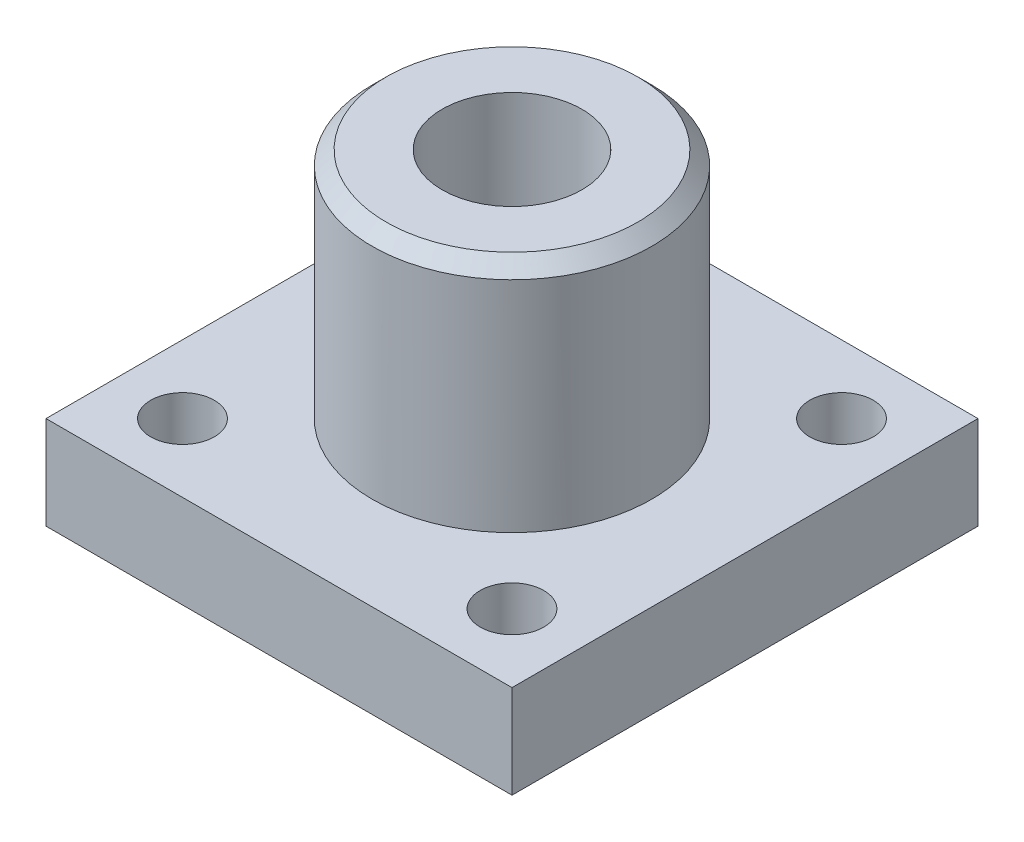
from build123d import *

# Parameters (mm, degrees)
SKETCH1_W          = 254
SKETCH1_H          = 254
EXTRUDE1_DEPTH     = 50.8
SKETCH2_R          = 17.324020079
CUT_EXTRUDE1_DEPTH = 187.6511184
SKETCH3_R          = 76.2
EXTRUDE2_DEPTH     = 127
CHAMFER1_SIZE      = 7.62
SKETCH4_R          = 38.1
CUT_EXTRUDE2_DEPTH = 253.726809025


with BuildPart() as part:
    # Sketch1 → Extrude1 (new body)
    with BuildSketch(Plane(origin=(0, 0, 0), x_dir=(1, 0, 0), z_dir=(0, 1, 0))):
        Rectangle(SKETCH1_W, SKETCH1_H)
    extrude(amount=EXTRUDE1_DEPTH)

    # Sketch2 → Cut-Extrude1 (cut, through all)
    with BuildSketch(Plane(origin=(0, 50.8, 0), x_dir=(1, 0, 0), z_dir=(0, 1, 0))):
        with Locations(Location((89.802561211, 89.802561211, 0), (0, 0, 270))):
            Circle(SKETCH2_R)
        with Locations(Location((-89.802561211, 89.802561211, 0), (0, 0, 270))):
            Circle(SKETCH2_R)
        with Locations(Location((-89.802561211, -89.802561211, 0), (0, 0, 270))):
            Circle(SKETCH2_R)
        with Locations(Location((89.802561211, -89.802561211, 0), (0, 0, 270))):
            Circle(SKETCH2_R)
    extrude(amount=-CUT_EXTRUDE1_DEPTH, mode=Mode.SUBTRACT)

    # Sketch3 → Extrude2 (add)
    with BuildSketch(Plane(origin=(0, 50.8, 0), x_dir=(1, 0, 0), z_dir=(0, 1, 0))):
        with Locations(Location((0, 0, 0), (0, 0, 90))):
            Circle(SKETCH3_R)
    extrude(amount=EXTRUDE2_DEPTH)

    # Chamfer1
    chamfer1_edges = [part.edges().sort_by_distance(p)[0] for p in [
        (0, 177.8, 76.2),
    ]]
    chamfer(chamfer1_edges, length=CHAMFER1_SIZE)

    # Sketch4 → Cut-Extrude2 (cut, through all)
    with BuildSketch(Plane(origin=(0, 177.8, 0), x_dir=(1, 0, 0), z_dir=(0, 1, 0))):
        with Locations(Location((0, 0, 0), (0, 0, 270))):
            Circle(SKETCH4_R)
    extrude(amount=-CUT_EXTRUDE2_DEPTH, mode=Mode.SUBTRACT)


solid = part.part
